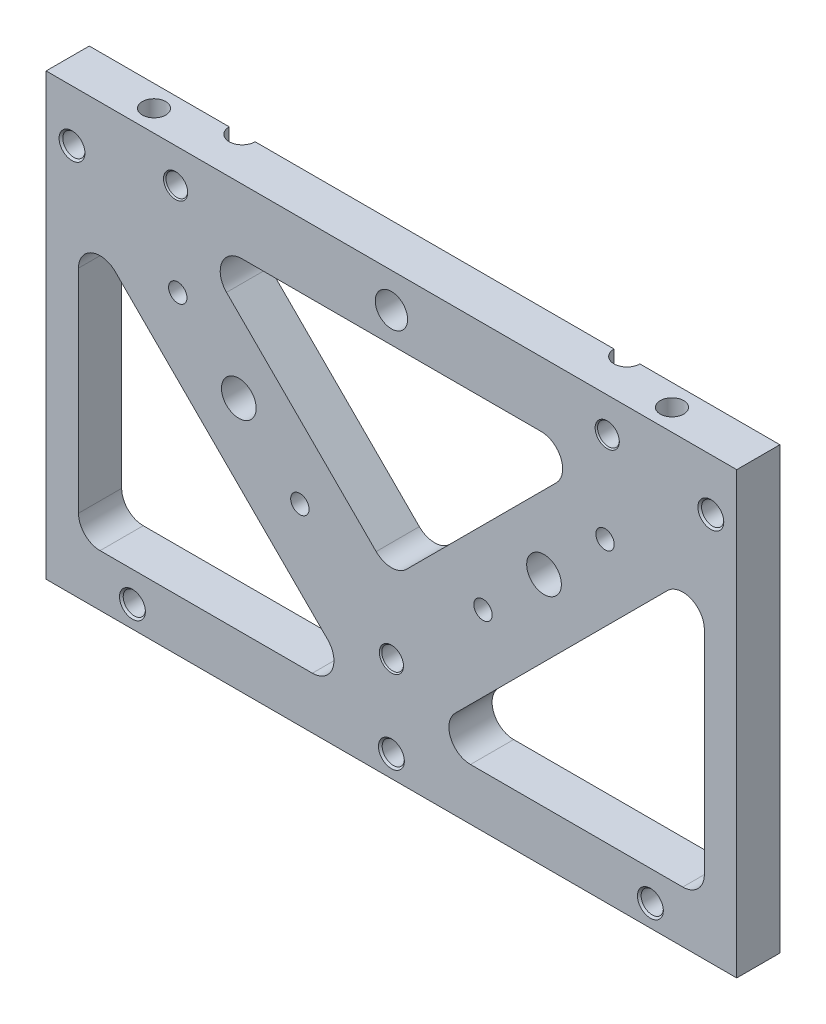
from build123d import *

# Parameters (mm, degrees)
SKETCH2_W                             = 101.6
SKETCH2_H                             = 64.77
BOSS_EXTRUDE1_DEPTH                   = 6.35
F_3_16_0_1875_DIAMETER_HOLE1_D        = 4.7625
F_6_32_TAPPED_HOLE1_D                 = 2.7051
SKETCH6_R                             = 3.1877
CUT_EXTRUDE2_DEPTH                    = 0.762
F_4_CLEARANCE_HOLE2_AT_2_COUNT        = 2
F_4_CLEARANCE_HOLE2_AT_2_PITCH        = 38.1
F_4_CLEARANCE_HOLE2_AT_3_COUNT        = 2
F_4_CLEARANCE_HOLE2_AT_3_PITCH        = 76.2
F_4_CLEARANCE_HOLE3_AT_2_COUNT        = 2
F_4_CLEARANCE_HOLE3_AT_2_PITCH        = 93.98
CUT_EXTRUDE4_DEPTH                    = 79.637513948
FILLET15_R                            = 3.175
FILLET23_R                            = 3.175
FILLET24_R                            = 3.175
FILLET25_R                            = 3.175
FILLET26_R                            = 3.175
F_1_8_0_125_DIAMETER_HOLE1_AT_2_COUNT = 2
F_1_8_0_125_DIAMETER_HOLE1_AT_2_PITCH = 63.5
F_1_8_0_125_DIAMETER_HOLE1_AT_3_COUNT = 2
F_1_8_0_125_DIAMETER_HOLE1_AT_3_PITCH = 54.624765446
F_8_32_TAPPED_HOLE1_D                 = 3.4544
F_8_32_TAPPED_HOLE1_DEPTH             = 26.924
F_8_32_TAPPED_HOLE1_TIP               = 1.037806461
F_1_4_20_TAPPED_HOLE1_D               = 5.1054
CUT_EXTRUDE5_DEPTH                    = 2.54


with BuildPart() as part:
    # Sketch2 → Boss-Extrude1 (new body)
    with BuildSketch(Plane.XY):
        with Locations((0, -27.305)):
            Rectangle(SKETCH2_W, SKETCH2_H)
    extrude(amount=BOSS_EXTRUDE1_DEPTH)

    # 3_16 _0.1875_ Diameter Hole1 (through all)
    with Locations(Plane.XY.offset(6.35)):
        with Locations((0, 0)):
            Hole(F_3_16_0_1875_DIAMETER_HOLE1_D / 2)

    # 6-32 Tapped Hole1 (through all)
    with Locations(Plane.XY.offset(6.35)):
        with Locations((-31.430896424, -13.470384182), (-13.470384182, -31.430896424)):
            f_6_32_tapped_hole1 = Hole(F_6_32_TAPPED_HOLE1_D / 2)

    # Sketch6 → Cut-Extrude2 (cut)
    with BuildSketch(Plane(origin=(0, 0, 0), x_dir=(-1, 0, 0), z_dir=(0, 0, -1))):
        Circle(SKETCH6_R)
    extrude(amount=-CUT_EXTRUDE2_DEPTH, mode=Mode.SUBTRACT)

    # Sketch7 → 4 Clearance Hole2 (revolve, cut)
    with BuildSketch(Plane(origin=(38.1, -56.515, 0), x_dir=(0, 1, 0), z_dir=(1, 0, 0))):
        Polygon((0, 0), (0, 6.35), (1.905, 6.35), (1.63195, 6.07695), (1.63195, 0.27305), (1.905, 0), align=None)
    f_4_clearance_hole2 = revolve(axis=Axis((38.1, -56.515, -6.35), (0, 0, 1)), mode=Mode.SUBTRACT)

    # 4 Clearance Hole2 at 2: 4 Clearance Hole2 ×2
    with Locations(*[(-i * F_4_CLEARANCE_HOLE2_AT_2_PITCH, 0, 0) for i in range(1, F_4_CLEARANCE_HOLE2_AT_2_COUNT)]):
        add(f_4_clearance_hole2, mode=Mode.SUBTRACT)

    # 4 Clearance Hole2 at 3: 4 Clearance Hole2 ×2
    with Locations(*[(-i * F_4_CLEARANCE_HOLE2_AT_3_PITCH, 0, 0) for i in range(1, F_4_CLEARANCE_HOLE2_AT_3_COUNT)]):
        add(f_4_clearance_hole2, mode=Mode.SUBTRACT)

    # Sketch14 → 4 Clearance Hole3 (revolve, cut)
    with BuildSketch(Plane(origin=(-46.99, -2.54, 6.35), x_dir=(0, -1, 0), z_dir=(1, 0, 0))):
        Polygon((0, 0), (0, 6.35), (1.905, 6.35), (1.63195, 6.07695), (1.63195, 0.27305), (1.905, 0), align=None)
    f_4_clearance_hole3 = revolve(axis=Axis((-46.99, -2.54, 12.7), (0, 0, -1)), mode=Mode.SUBTRACT)

    # 4 Clearance Hole3 at 2: 4 Clearance Hole3 ×2
    with Locations(*[(i * F_4_CLEARANCE_HOLE3_AT_2_PITCH, 0, 0) for i in range(1, F_4_CLEARANCE_HOLE3_AT_2_COUNT)]):
        add(f_4_clearance_hole3, mode=Mode.SUBTRACT)

    # Sketch15 → Cut-Extrude4 (cut, through all)
    with BuildSketch(Plane.XY.offset(6.35)):
        Polygon((-46.0375, -9.999298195), (-3.966798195, -52.07), (-46.0375, -52.07), align=None)
        Polygon((-29.67997326, -4.445), (0, -34.12497326), (29.67997326, -4.445), align=None)
        Polygon((46.0375, -9.999298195), (46.0375, -52.07), (3.966798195, -52.07), align=None)
    extrude(amount=-CUT_EXTRUDE4_DEPTH, mode=Mode.SUBTRACT)

    # Fillet15
    fillet15_edges = [part.edges().sort_by_distance(p)[0] for p in [
        (-29.67997326, -4.445, 3.175),
        (29.67997326, -4.445, 3.175),
    ]]
    fillet(fillet15_edges, radius=FILLET15_R)

    # Fillet23
    fillet23_edges = [part.edges().sort_by_distance(p)[0] for p in [
        (46.0375, -9.999298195, 3.175),
    ]]
    fillet(fillet23_edges, radius=FILLET23_R)

    # Fillet24
    fillet24_edges = [part.edges().sort_by_distance(p)[0] for p in [
        (3.966798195, -52.07, 3.175),
        (46.0375, -52.07, 3.175),
    ]]
    fillet(fillet24_edges, radius=FILLET24_R)

    # Fillet25
    fillet25_edges = [part.edges().sort_by_distance(p)[0] for p in [
        (0, -34.12497326, 3.175),
    ]]
    fillet(fillet25_edges, radius=FILLET25_R)

    # Fillet26
    fillet26_edges = [part.edges().sort_by_distance(p)[0] for p in [
        (-46.0375, -52.07, 3.175),
        (-46.0375, -9.999298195, 3.175),
        (-3.966798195, -52.07, 3.175),
    ]]
    fillet(fillet26_edges, radius=FILLET26_R)

    # Mirror1: 6-32 Tapped Hole1 across plane
    add(f_6_32_tapped_hole1.mirror(Plane(origin=(0, 0, 0), x_dir=(0, 0, 1), z_dir=(1, 0, 0))), mode=Mode.SUBTRACT)

    # Sketch18 → 1_8 _0.125_ Diameter Hole1 (revolve, cut)
    with BuildSketch(Plane(origin=(-31.75, 0, 6.35), x_dir=(0, -1, 0), z_dir=(1, 0, 0))):
        Polygon((0, 0), (0, 6.35), (1.778, 6.35), (1.6002, 6.1722), (1.6002, 0.1778), (1.778, 0), align=None)
    f_1_8_0_125_diameter_hole1 = revolve(axis=Axis((-31.75, 0, 12.7), (0, 0, -1)), mode=Mode.SUBTRACT)

    # 1_8 _0.125_ Diameter Hole1 at 2: 1_8 _0.125_ Diameter Hole1 ×2
    with Locations(*[(i * F_1_8_0_125_DIAMETER_HOLE1_AT_2_PITCH, 0, 0) for i in range(1, F_1_8_0_125_DIAMETER_HOLE1_AT_2_COUNT)]):
        add(f_1_8_0_125_diameter_hole1, mode=Mode.SUBTRACT)

    # 1_8 _0.125_ Diameter Hole1 at 3: 1_8 _0.125_ Diameter Hole1 ×2
    with Locations(*[Vector(0.5812381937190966, -0.8137334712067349, 0) * (i * F_1_8_0_125_DIAMETER_HOLE1_AT_3_PITCH) for i in range(1, F_1_8_0_125_DIAMETER_HOLE1_AT_3_COUNT)]):
        add(f_1_8_0_125_diameter_hole1, mode=Mode.SUBTRACT)

    # 8-32 Tapped Hole1
    with Locations(Plane(origin=(0, 5.08, 0), x_dir=(-1, 0, 0), z_dir=(0, 1, 0))):
        with Locations((-38.1, 3.175), (38.1, 3.175)):
            Hole(F_8_32_TAPPED_HOLE1_D / 2, depth=F_8_32_TAPPED_HOLE1_DEPTH)
            with Locations((0, 0, -(F_8_32_TAPPED_HOLE1_DEPTH + F_8_32_TAPPED_HOLE1_TIP / 2))):  # 118° drill point
                Cone(0, F_8_32_TAPPED_HOLE1_D / 2, F_8_32_TAPPED_HOLE1_TIP, mode=Mode.SUBTRACT)

    # 1_4-20 Tapped Hole1 (through all)
    with Locations(Plane(origin=(0, 0, 0), x_dir=(-1, 0, 0), z_dir=(0, 0, -1))):
        with Locations((-22.450640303, -22.450640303), (22.450640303, -22.450640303)):
            Hole(F_1_4_20_TAPPED_HOLE1_D / 2)

    # Sketch24 → Cut-Extrude5 (cut)
    with BuildSketch(Plane(origin=(0, 5.08, 0), x_dir=(1, 0, 0), z_dir=(0, 1, 0))):
        with BuildLine():
            Line((-26.39822, 0), (-30.20822, 0))
            ThreePointArc((-30.20822, 0), (-28.30322, -1.905), (-26.39822, 0))
        make_face()
        with BuildLine():
            Line((26.39822, 0), (30.20822, 0))
            ThreePointArc((30.20822, 0), (28.30322, -1.905), (26.39822, 0))
        make_face()
    extrude(amount=-CUT_EXTRUDE5_DEPTH, mode=Mode.SUBTRACT)


solid = part.part
